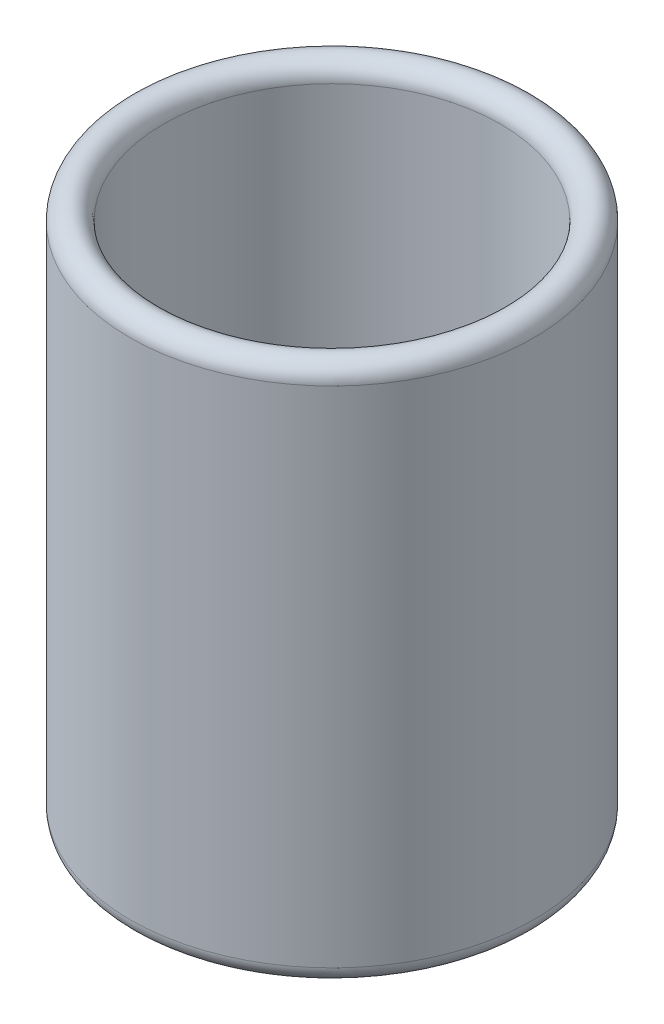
ISO-10303-21;
HEADER;
FILE_DESCRIPTION(('STEP AP214'),'2;1');
FILE_NAME('part.step','',(''),(''),'','','');
FILE_SCHEMA(('AUTOMOTIVE_DESIGN { 1 0 10303 214 1 1 1 1 }'));
ENDSEC;
DATA;
#1=APPLICATION_CONTEXT('core data for automotive mechanical design processes');
#2=APPLICATION_PROTOCOL_DEFINITION('international standard','automotive_design',2000,#1);
#3=PRODUCT_CONTEXT('',#1,'mechanical');
#4=PRODUCT('Part','Part','',(#3));
#5=PRODUCT_RELATED_PRODUCT_CATEGORY('part','',(#4));
#6=PRODUCT_DEFINITION_FORMATION('','',#4);
#7=PRODUCT_DEFINITION_CONTEXT('part definition',#1,'design');
#8=PRODUCT_DEFINITION('design','',#6,#7);
#9=PRODUCT_DEFINITION_SHAPE('','',#8);
#10=(LENGTH_UNIT() NAMED_UNIT(*) SI_UNIT(.MILLI.,.METRE.));
#11=(NAMED_UNIT(*) PLANE_ANGLE_UNIT() SI_UNIT($,.RADIAN.));
#12=(NAMED_UNIT(*) SI_UNIT($,.STERADIAN.) SOLID_ANGLE_UNIT());
#13=UNCERTAINTY_MEASURE_WITH_UNIT(LENGTH_MEASURE(1.E-05),#10,'distance_accuracy_value','');
#14=(GEOMETRIC_REPRESENTATION_CONTEXT(3) GLOBAL_UNCERTAINTY_ASSIGNED_CONTEXT((#13)) GLOBAL_UNIT_ASSIGNED_CONTEXT((#10,
#11,#12)) REPRESENTATION_CONTEXT('',''));
#15=CARTESIAN_POINT('',(0.,0.,0.));
#16=DIRECTION('',(0.,0.,1.));
#17=DIRECTION('',(1.,0.,0.));
#18=AXIS2_PLACEMENT_3D('',#15,#16,#17);
#19=CARTESIAN_POINT('',(0.,0.0999999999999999,0.));
#20=DIRECTION('',(0.,1.,0.));
#21=DIRECTION('',(0.,0.,1.));
#22=AXIS2_PLACEMENT_3D('',#19,#20,#21);
#23=TOROIDAL_SURFACE('',#22,1.095,0.0999999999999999);
#24=CARTESIAN_POINT('',(0.,0.0999999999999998,0.));
#25=DIRECTION('',(0.,1.,0.));
#26=DIRECTION('',(0.,0.,1.));
#27=AXIS2_PLACEMENT_3D('',#24,#25,#26);
#28=CIRCLE('',#27,0.995);
#29=CARTESIAN_POINT('',(0.,0.0999999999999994,-0.995));
#30=VERTEX_POINT('',#29);
#31=EDGE_CURVE('E42',#30,#30,#28,.F.);
#32=ORIENTED_EDGE('',*,*,#31,.F.);
#33=EDGE_LOOP('',(#32));
#34=FACE_BOUND('',#33,.T.);
#35=CARTESIAN_POINT('',(0.,0.0999999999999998,0.));
#36=DIRECTION('',(0.,1.,0.));
#37=DIRECTION('',(0.,0.,1.));
#38=AXIS2_PLACEMENT_3D('',#35,#36,#37);
#39=CIRCLE('',#38,1.195);
#40=CARTESIAN_POINT('',(0.,0.0999999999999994,-1.195));
#41=VERTEX_POINT('',#40);
#42=EDGE_CURVE('E10',#41,#41,#39,.T.);
#43=ORIENTED_EDGE('',*,*,#42,.F.);
#44=EDGE_LOOP('',(#43));
#45=FACE_BOUND('',#44,.T.);
#46=ADVANCED_FACE('F35',(#34,#45),#23,.T.);
#47=CARTESIAN_POINT('',(0.,3.08,0.));
#48=DIRECTION('',(0.,1.,0.));
#49=DIRECTION('',(0.,0.,1.));
#50=AXIS2_PLACEMENT_3D('',#47,#48,#49);
#51=TOROIDAL_SURFACE('',#50,1.095,0.0999999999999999);
#52=CARTESIAN_POINT('',(0.,3.08,0.));
#53=DIRECTION('',(0.,1.,0.));
#54=DIRECTION('',(0.,0.,1.));
#55=AXIS2_PLACEMENT_3D('',#52,#53,#54);
#56=CIRCLE('',#55,1.195);
#57=CARTESIAN_POINT('',(0.,3.08,-1.195));
#58=VERTEX_POINT('',#57);
#59=EDGE_CURVE('E50',#58,#58,#56,.F.);
#60=ORIENTED_EDGE('',*,*,#59,.F.);
#61=EDGE_LOOP('',(#60));
#62=FACE_BOUND('',#61,.T.);
#63=CARTESIAN_POINT('',(0.,3.08,0.));
#64=DIRECTION('',(0.,1.,0.));
#65=DIRECTION('',(0.,0.,1.));
#66=AXIS2_PLACEMENT_3D('',#63,#64,#65);
#67=CIRCLE('',#66,0.995);
#68=CARTESIAN_POINT('',(0.,3.08,-0.995));
#69=VERTEX_POINT('',#68);
#70=EDGE_CURVE('E46',#69,#69,#67,.T.);
#71=ORIENTED_EDGE('',*,*,#70,.F.);
#72=EDGE_LOOP('',(#71));
#73=FACE_BOUND('',#72,.T.);
#74=ADVANCED_FACE('F58',(#62,#73),#51,.T.);
#75=CARTESIAN_POINT('',(0.,3.18,0.));
#76=DIRECTION('',(0.,-1.,0.));
#77=DIRECTION('',(0.,0.,-1.));
#78=AXIS2_PLACEMENT_3D('',#75,#76,#77);
#79=CYLINDRICAL_SURFACE('',#78,1.195);
#80=CARTESIAN_POINT('',(0.,0.0999999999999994,-1.195));
#81=CARTESIAN_POINT('',(0.,0.131041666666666,-1.195));
#82=CARTESIAN_POINT('',(0.,0.162083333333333,-1.195));
#83=CARTESIAN_POINT('',(0.,0.224166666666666,-1.195));
#84=CARTESIAN_POINT('',(0.,0.255208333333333,-1.195));
#85=CARTESIAN_POINT('',(0.,0.317291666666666,-1.195));
#86=CARTESIAN_POINT('',(0.,0.348333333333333,-1.195));
#87=CARTESIAN_POINT('',(0.,0.410416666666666,-1.195));
#88=CARTESIAN_POINT('',(0.,0.441458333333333,-1.195));
#89=CARTESIAN_POINT('',(0.,0.503541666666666,-1.195));
#90=CARTESIAN_POINT('',(0.,0.534583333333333,-1.195));
#91=CARTESIAN_POINT('',(0.,0.596666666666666,-1.195));
#92=CARTESIAN_POINT('',(0.,0.627708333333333,-1.195));
#93=CARTESIAN_POINT('',(0.,0.689791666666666,-1.195));
#94=CARTESIAN_POINT('',(0.,0.720833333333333,-1.195));
#95=CARTESIAN_POINT('',(0.,0.782916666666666,-1.195));
#96=CARTESIAN_POINT('',(0.,0.813958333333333,-1.195));
#97=CARTESIAN_POINT('',(0.,0.876041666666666,-1.195));
#98=CARTESIAN_POINT('',(0.,0.907083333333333,-1.195));
#99=CARTESIAN_POINT('',(0.,0.969166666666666,-1.195));
#100=CARTESIAN_POINT('',(0.,1.00020833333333,-1.195));
#101=CARTESIAN_POINT('',(0.,1.06229166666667,-1.195));
#102=CARTESIAN_POINT('',(0.,1.09333333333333,-1.195));
#103=CARTESIAN_POINT('',(0.,1.15541666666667,-1.195));
#104=CARTESIAN_POINT('',(0.,1.18645833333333,-1.195));
#105=CARTESIAN_POINT('',(0.,1.24854166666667,-1.195));
#106=CARTESIAN_POINT('',(0.,1.27958333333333,-1.195));
#107=CARTESIAN_POINT('',(0.,1.34166666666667,-1.195));
#108=CARTESIAN_POINT('',(0.,1.37270833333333,-1.195));
#109=CARTESIAN_POINT('',(0.,1.43479166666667,-1.195));
#110=CARTESIAN_POINT('',(0.,1.46583333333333,-1.195));
#111=CARTESIAN_POINT('',(0.,1.52791666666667,-1.195));
#112=CARTESIAN_POINT('',(0.,1.55895833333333,-1.195));
#113=CARTESIAN_POINT('',(0.,1.62104166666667,-1.195));
#114=CARTESIAN_POINT('',(0.,1.65208333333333,-1.195));
#115=CARTESIAN_POINT('',(0.,1.71416666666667,-1.195));
#116=CARTESIAN_POINT('',(0.,1.74520833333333,-1.195));
#117=CARTESIAN_POINT('',(0.,1.80729166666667,-1.195));
#118=CARTESIAN_POINT('',(0.,1.83833333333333,-1.195));
#119=CARTESIAN_POINT('',(0.,1.90041666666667,-1.195));
#120=CARTESIAN_POINT('',(0.,1.93145833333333,-1.195));
#121=CARTESIAN_POINT('',(0.,1.99354166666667,-1.195));
#122=CARTESIAN_POINT('',(0.,2.02458333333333,-1.195));
#123=CARTESIAN_POINT('',(0.,2.08666666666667,-1.195));
#124=CARTESIAN_POINT('',(0.,2.11770833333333,-1.195));
#125=CARTESIAN_POINT('',(0.,2.17979166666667,-1.195));
#126=CARTESIAN_POINT('',(0.,2.21083333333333,-1.195));
#127=CARTESIAN_POINT('',(0.,2.27291666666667,-1.195));
#128=CARTESIAN_POINT('',(0.,2.30395833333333,-1.195));
#129=CARTESIAN_POINT('',(0.,2.36604166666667,-1.195));
#130=CARTESIAN_POINT('',(0.,2.39708333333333,-1.195));
#131=CARTESIAN_POINT('',(0.,2.45916666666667,-1.195));
#132=CARTESIAN_POINT('',(0.,2.49020833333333,-1.195));
#133=CARTESIAN_POINT('',(0.,2.55229166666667,-1.195));
#134=CARTESIAN_POINT('',(0.,2.58333333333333,-1.195));
#135=CARTESIAN_POINT('',(0.,2.64541666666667,-1.195));
#136=CARTESIAN_POINT('',(0.,2.67645833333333,-1.195));
#137=CARTESIAN_POINT('',(0.,2.73854166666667,-1.195));
#138=CARTESIAN_POINT('',(0.,2.76958333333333,-1.195));
#139=CARTESIAN_POINT('',(0.,2.83166666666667,-1.195));
#140=CARTESIAN_POINT('',(0.,2.86270833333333,-1.195));
#141=CARTESIAN_POINT('',(0.,2.92479166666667,-1.195));
#142=CARTESIAN_POINT('',(0.,2.95583333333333,-1.195));
#143=CARTESIAN_POINT('',(0.,3.01791666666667,-1.195));
#144=CARTESIAN_POINT('',(0.,3.04895833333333,-1.195));
#145=CARTESIAN_POINT('',(0.,3.08,-1.195));
#146=B_SPLINE_CURVE_WITH_KNOTS('',3,(#80,#81,#82,#83,#84,#85,#86,#87,#88,#89,#90,#91,#92,#93,
#94,#95,#96,#97,#98,#99,#100,#101,#102,#103,#104,#105,#106,#107,#108,#109,#110,#111,#112,#113,
#114,#115,#116,#117,#118,#119,#120,#121,#122,#123,#124,#125,#126,#127,#128,#129,#130,#131,#132,
#133,#134,#135,#136,#137,#138,#139,#140,#141,#142,#143,#144,#145),.UNSPECIFIED.,.F.,.F.,(4,2,2,
2,2,2,2,2,2,2,2,2,2,2,2,2,2,2,2,2,2,2,2,2,2,2,2,2,2,2,2,2,4),(0.,0.0931249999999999,0.18625,
0.279375,0.3725,0.465625,0.55875,0.651875,0.745,0.838125,0.93125,1.024375,1.1175,1.210625,
1.30375,1.396875,1.49,1.583125,1.67625,1.769375,1.8625,1.955625,2.04875,2.141875,2.235,2.328125,
2.42125,2.514375,2.6075,2.700625,2.79375,2.886875,2.98),.UNSPECIFIED.);
#147=EDGE_CURVE('BSEAM56',#41,#58,#146,.T.);
#148=ORIENTED_EDGE('',*,*,#42,.T.);
#149=ORIENTED_EDGE('',*,*,#59,.T.);
#150=ORIENTED_EDGE('',*,*,#147,.T.);
#151=ORIENTED_EDGE('',*,*,#147,.F.);
#152=EDGE_LOOP('',(#148,#150,#149,#151));
#153=FACE_BOUND('',#152,.T.);
#154=ADVANCED_FACE('F56',(#153),#79,.T.);
#155=CARTESIAN_POINT('',(0.,3.18,0.));
#156=DIRECTION('',(0.,-1.,0.));
#157=DIRECTION('',(0.,0.,-1.));
#158=AXIS2_PLACEMENT_3D('',#155,#156,#157);
#159=CYLINDRICAL_SURFACE('',#158,0.995);
#160=CARTESIAN_POINT('',(0.,0.0999999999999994,-0.995));
#161=CARTESIAN_POINT('',(0.,0.131041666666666,-0.995));
#162=CARTESIAN_POINT('',(0.,0.162083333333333,-0.995));
#163=CARTESIAN_POINT('',(0.,0.224166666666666,-0.995));
#164=CARTESIAN_POINT('',(0.,0.255208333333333,-0.995));
#165=CARTESIAN_POINT('',(0.,0.317291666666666,-0.995));
#166=CARTESIAN_POINT('',(0.,0.348333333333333,-0.995));
#167=CARTESIAN_POINT('',(0.,0.410416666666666,-0.995));
#168=CARTESIAN_POINT('',(0.,0.441458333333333,-0.995));
#169=CARTESIAN_POINT('',(0.,0.503541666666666,-0.995));
#170=CARTESIAN_POINT('',(0.,0.534583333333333,-0.995));
#171=CARTESIAN_POINT('',(0.,0.596666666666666,-0.995));
#172=CARTESIAN_POINT('',(0.,0.627708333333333,-0.995));
#173=CARTESIAN_POINT('',(0.,0.689791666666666,-0.995));
#174=CARTESIAN_POINT('',(0.,0.720833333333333,-0.995));
#175=CARTESIAN_POINT('',(0.,0.782916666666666,-0.995));
#176=CARTESIAN_POINT('',(0.,0.813958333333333,-0.995));
#177=CARTESIAN_POINT('',(0.,0.876041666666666,-0.995));
#178=CARTESIAN_POINT('',(0.,0.907083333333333,-0.995));
#179=CARTESIAN_POINT('',(0.,0.969166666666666,-0.995));
#180=CARTESIAN_POINT('',(0.,1.00020833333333,-0.995));
#181=CARTESIAN_POINT('',(0.,1.06229166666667,-0.995));
#182=CARTESIAN_POINT('',(0.,1.09333333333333,-0.995));
#183=CARTESIAN_POINT('',(0.,1.15541666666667,-0.995));
#184=CARTESIAN_POINT('',(0.,1.18645833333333,-0.995));
#185=CARTESIAN_POINT('',(0.,1.24854166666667,-0.995));
#186=CARTESIAN_POINT('',(0.,1.27958333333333,-0.995));
#187=CARTESIAN_POINT('',(0.,1.34166666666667,-0.995));
#188=CARTESIAN_POINT('',(0.,1.37270833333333,-0.995));
#189=CARTESIAN_POINT('',(0.,1.43479166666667,-0.995));
#190=CARTESIAN_POINT('',(0.,1.46583333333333,-0.995));
#191=CARTESIAN_POINT('',(0.,1.52791666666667,-0.995));
#192=CARTESIAN_POINT('',(0.,1.55895833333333,-0.995));
#193=CARTESIAN_POINT('',(0.,1.62104166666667,-0.995));
#194=CARTESIAN_POINT('',(0.,1.65208333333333,-0.995));
#195=CARTESIAN_POINT('',(0.,1.71416666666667,-0.995));
#196=CARTESIAN_POINT('',(0.,1.74520833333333,-0.995));
#197=CARTESIAN_POINT('',(0.,1.80729166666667,-0.995));
#198=CARTESIAN_POINT('',(0.,1.83833333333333,-0.995));
#199=CARTESIAN_POINT('',(0.,1.90041666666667,-0.995));
#200=CARTESIAN_POINT('',(0.,1.93145833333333,-0.995));
#201=CARTESIAN_POINT('',(0.,1.99354166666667,-0.995));
#202=CARTESIAN_POINT('',(0.,2.02458333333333,-0.995));
#203=CARTESIAN_POINT('',(0.,2.08666666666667,-0.995));
#204=CARTESIAN_POINT('',(0.,2.11770833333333,-0.995));
#205=CARTESIAN_POINT('',(0.,2.17979166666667,-0.995));
#206=CARTESIAN_POINT('',(0.,2.21083333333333,-0.995));
#207=CARTESIAN_POINT('',(0.,2.27291666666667,-0.995));
#208=CARTESIAN_POINT('',(0.,2.30395833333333,-0.995));
#209=CARTESIAN_POINT('',(0.,2.36604166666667,-0.995));
#210=CARTESIAN_POINT('',(0.,2.39708333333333,-0.995));
#211=CARTESIAN_POINT('',(0.,2.45916666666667,-0.995));
#212=CARTESIAN_POINT('',(0.,2.49020833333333,-0.995));
#213=CARTESIAN_POINT('',(0.,2.55229166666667,-0.995));
#214=CARTESIAN_POINT('',(0.,2.58333333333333,-0.995));
#215=CARTESIAN_POINT('',(0.,2.64541666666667,-0.995));
#216=CARTESIAN_POINT('',(0.,2.67645833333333,-0.995));
#217=CARTESIAN_POINT('',(0.,2.73854166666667,-0.995));
#218=CARTESIAN_POINT('',(0.,2.76958333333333,-0.995));
#219=CARTESIAN_POINT('',(0.,2.83166666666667,-0.995));
#220=CARTESIAN_POINT('',(0.,2.86270833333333,-0.995));
#221=CARTESIAN_POINT('',(0.,2.92479166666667,-0.995));
#222=CARTESIAN_POINT('',(0.,2.95583333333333,-0.995));
#223=CARTESIAN_POINT('',(0.,3.01791666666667,-0.995));
#224=CARTESIAN_POINT('',(0.,3.04895833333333,-0.995));
#225=CARTESIAN_POINT('',(0.,3.08,-0.995));
#226=B_SPLINE_CURVE_WITH_KNOTS('',3,(#160,#161,#162,#163,#164,#165,#166,#167,#168,#169,#170,
#171,#172,#173,#174,#175,#176,#177,#178,#179,#180,#181,#182,#183,#184,#185,#186,#187,#188,#189,
#190,#191,#192,#193,#194,#195,#196,#197,#198,#199,#200,#201,#202,#203,#204,#205,#206,#207,#208,
#209,#210,#211,#212,#213,#214,#215,#216,#217,#218,#219,#220,#221,#222,#223,#224,#225),
.UNSPECIFIED.,.F.,.F.,(4,2,2,2,2,2,2,2,2,2,2,2,2,2,2,2,2,2,2,2,2,2,2,2,2,2,2,2,2,2,2,2,4),(0.,
0.0931249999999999,0.18625,0.279375,0.3725,0.465625,0.55875,0.651875,0.745,0.838125,0.93125,
1.024375,1.1175,1.210625,1.30375,1.396875,1.49,1.583125,1.67625,1.769375,1.8625,1.955625,
2.04875,2.141875,2.235,2.328125,2.42125,2.514375,2.6075,2.700625,2.79375,2.886875,2.98),.UNSPECIFIED.);
#227=EDGE_CURVE('BSEAM63',#30,#69,#226,.T.);
#228=ORIENTED_EDGE('',*,*,#31,.T.);
#229=ORIENTED_EDGE('',*,*,#70,.T.);
#230=ORIENTED_EDGE('',*,*,#227,.T.);
#231=ORIENTED_EDGE('',*,*,#227,.F.);
#232=EDGE_LOOP('',(#228,#230,#229,#231));
#233=FACE_BOUND('',#232,.T.);
#234=ADVANCED_FACE('F63',(#233),#159,.F.);
#235=CLOSED_SHELL('',(#46,#74,#154,#234));
#236=MANIFOLD_SOLID_BREP('B2',#235);
#237=ADVANCED_BREP_SHAPE_REPRESENTATION('',(#18,#236),#14);
#238=SHAPE_DEFINITION_REPRESENTATION(#9,#237);
ENDSEC;
END-ISO-10303-21;
